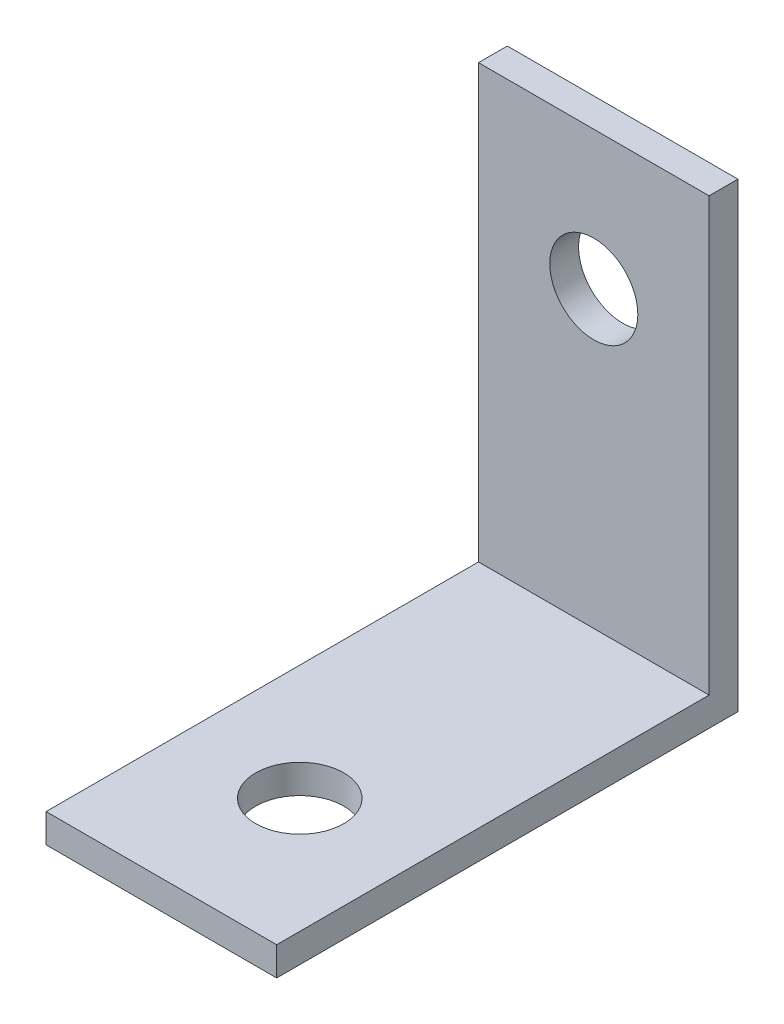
ISO-10303-21;
HEADER;
FILE_DESCRIPTION(('STEP AP214'),'2;1');
FILE_NAME('part.step','',(''),(''),'','','');
FILE_SCHEMA(('AUTOMOTIVE_DESIGN { 1 0 10303 214 1 1 1 1 }'));
ENDSEC;
DATA;
#1=APPLICATION_CONTEXT('core data for automotive mechanical design processes');
#2=APPLICATION_PROTOCOL_DEFINITION('international standard','automotive_design',2000,#1);
#3=PRODUCT_CONTEXT('',#1,'mechanical');
#4=PRODUCT('Part','Part','',(#3));
#5=PRODUCT_RELATED_PRODUCT_CATEGORY('part','',(#4));
#6=PRODUCT_DEFINITION_FORMATION('','',#4);
#7=PRODUCT_DEFINITION_CONTEXT('part definition',#1,'design');
#8=PRODUCT_DEFINITION('design','',#6,#7);
#9=PRODUCT_DEFINITION_SHAPE('','',#8);
#10=(LENGTH_UNIT() NAMED_UNIT(*) SI_UNIT(.MILLI.,.METRE.));
#11=(NAMED_UNIT(*) PLANE_ANGLE_UNIT() SI_UNIT($,.RADIAN.));
#12=(NAMED_UNIT(*) SI_UNIT($,.STERADIAN.) SOLID_ANGLE_UNIT());
#13=UNCERTAINTY_MEASURE_WITH_UNIT(LENGTH_MEASURE(1.E-05),#10,'distance_accuracy_value','');
#14=(GEOMETRIC_REPRESENTATION_CONTEXT(3) GLOBAL_UNCERTAINTY_ASSIGNED_CONTEXT((#13)) GLOBAL_UNIT_ASSIGNED_CONTEXT((#10,
#11,#12)) REPRESENTATION_CONTEXT('',''));
#15=CARTESIAN_POINT('',(0.,0.,0.));
#16=DIRECTION('',(0.,0.,1.));
#17=DIRECTION('',(1.,0.,0.));
#18=AXIS2_PLACEMENT_3D('',#15,#16,#17);
#19=CARTESIAN_POINT('',(6.35,0.,0.));
#20=DIRECTION('',(0.,1.,0.));
#21=DIRECTION('',(0.,0.,1.));
#22=AXIS2_PLACEMENT_3D('',#19,#20,#21);
#23=PLANE('',#22);
#24=CARTESIAN_POINT('',(0.,0.,17.78));
#25=DIRECTION('',(0.,-1.,0.));
#26=DIRECTION('',(1.,0.,0.));
#27=AXIS2_PLACEMENT_3D('',#24,#25,#26);
#28=CIRCLE('',#27,2.4257);
#29=CARTESIAN_POINT('',(0.,0.,20.2057));
#30=VERTEX_POINT('',#29);
#31=EDGE_CURVE('E155',#30,#30,#28,.T.);
#32=ORIENTED_EDGE('',*,*,#31,.F.);
#33=EDGE_LOOP('',(#32));
#34=FACE_BOUND('',#33,.T.);
#35=DIRECTION('',(0.,0.,-1.));
#36=VECTOR('',#35,1.);
#37=CARTESIAN_POINT('',(-6.35,0.,0.));
#38=LINE('',#37,#36);
#39=CARTESIAN_POINT('',(-6.35,0.,25.4));
#40=VERTEX_POINT('',#39);
#41=CARTESIAN_POINT('',(-6.35,0.,0.));
#42=VERTEX_POINT('',#41);
#43=EDGE_CURVE('E130',#40,#42,#38,.T.);
#44=ORIENTED_EDGE('',*,*,#43,.T.);
#45=DIRECTION('',(-1.,0.,0.));
#46=VECTOR('',#45,1.);
#47=CARTESIAN_POINT('',(6.35,0.,0.));
#48=LINE('',#47,#46);
#49=CARTESIAN_POINT('',(6.35,0.,0.));
#50=VERTEX_POINT('',#49);
#51=EDGE_CURVE('E11',#50,#42,#48,.T.);
#52=ORIENTED_EDGE('',*,*,#51,.F.);
#53=DIRECTION('',(0.,0.,-1.));
#54=VECTOR('',#53,1.);
#55=CARTESIAN_POINT('',(6.35,0.,0.));
#56=LINE('',#55,#54);
#57=CARTESIAN_POINT('',(6.35,0.,25.4));
#58=VERTEX_POINT('',#57);
#59=EDGE_CURVE('E137',#58,#50,#56,.T.);
#60=ORIENTED_EDGE('',*,*,#59,.F.);
#61=DIRECTION('',(-1.,0.,0.));
#62=VECTOR('',#61,1.);
#63=CARTESIAN_POINT('',(6.35,0.,25.4));
#64=LINE('',#63,#62);
#65=EDGE_CURVE('E122',#58,#40,#64,.T.);
#66=ORIENTED_EDGE('',*,*,#65,.T.);
#67=EDGE_LOOP('',(#44,#52,#60,#66));
#68=FACE_BOUND('',#67,.T.);
#69=ADVANCED_FACE('F41',(#34,#68),#23,.F.);
#70=CARTESIAN_POINT('',(6.35,0.,0.));
#71=DIRECTION('',(0.,0.,1.));
#72=DIRECTION('',(1.,0.,0.));
#73=AXIS2_PLACEMENT_3D('',#70,#71,#72);
#74=PLANE('',#73);
#75=CARTESIAN_POINT('',(0.,17.78,0.));
#76=DIRECTION('',(0.,0.,1.));
#77=DIRECTION('',(1.,0.,0.));
#78=AXIS2_PLACEMENT_3D('',#75,#76,#77);
#79=CIRCLE('',#78,2.4257);
#80=CARTESIAN_POINT('',(2.4257,17.78,0.));
#81=VERTEX_POINT('',#80);
#82=EDGE_CURVE('E145',#81,#81,#79,.T.);
#83=ORIENTED_EDGE('',*,*,#82,.T.);
#84=EDGE_LOOP('',(#83));
#85=FACE_BOUND('',#84,.T.);
#86=DIRECTION('',(0.,1.,0.));
#87=VECTOR('',#86,1.);
#88=CARTESIAN_POINT('',(-6.35,0.,0.));
#89=LINE('',#88,#87);
#90=CARTESIAN_POINT('',(-6.35,25.4,0.));
#91=VERTEX_POINT('',#90);
#92=EDGE_CURVE('E128',#42,#91,#89,.T.);
#93=ORIENTED_EDGE('',*,*,#92,.T.);
#94=DIRECTION('',(-1.,0.,0.));
#95=VECTOR('',#94,1.);
#96=CARTESIAN_POINT('',(6.35,25.4,0.));
#97=LINE('',#96,#95);
#98=CARTESIAN_POINT('',(6.35,25.4,0.));
#99=VERTEX_POINT('',#98);
#100=EDGE_CURVE('E49',#99,#91,#97,.T.);
#101=ORIENTED_EDGE('',*,*,#100,.F.);
#102=DIRECTION('',(0.,1.,0.));
#103=VECTOR('',#102,1.);
#104=CARTESIAN_POINT('',(6.35,0.,0.));
#105=LINE('',#104,#103);
#106=EDGE_CURVE('E96',#50,#99,#105,.T.);
#107=ORIENTED_EDGE('',*,*,#106,.F.);
#108=ORIENTED_EDGE('',*,*,#51,.T.);
#109=EDGE_LOOP('',(#93,#101,#107,#108));
#110=FACE_BOUND('',#109,.T.);
#111=ADVANCED_FACE('F158',(#85,#110),#74,.F.);
#112=CARTESIAN_POINT('',(6.35,25.4,0.));
#113=DIRECTION('',(0.,-1.,0.));
#114=DIRECTION('',(0.,0.,-1.));
#115=AXIS2_PLACEMENT_3D('',#112,#113,#114);
#116=PLANE('',#115);
#117=DIRECTION('',(0.,0.,1.));
#118=VECTOR('',#117,1.);
#119=CARTESIAN_POINT('',(-6.35,25.4,0.));
#120=LINE('',#119,#118);
#121=CARTESIAN_POINT('',(-6.35,25.4,1.5875));
#122=VERTEX_POINT('',#121);
#123=EDGE_CURVE('E132',#91,#122,#120,.T.);
#124=ORIENTED_EDGE('',*,*,#123,.T.);
#125=DIRECTION('',(-1.,0.,0.));
#126=VECTOR('',#125,1.);
#127=CARTESIAN_POINT('',(6.35,25.4,1.5875));
#128=LINE('',#127,#126);
#129=CARTESIAN_POINT('',(6.35,25.4,1.5875));
#130=VERTEX_POINT('',#129);
#131=EDGE_CURVE('E117',#130,#122,#128,.T.);
#132=ORIENTED_EDGE('',*,*,#131,.F.);
#133=DIRECTION('',(0.,0.,1.));
#134=VECTOR('',#133,1.);
#135=CARTESIAN_POINT('',(6.35,25.4,0.));
#136=LINE('',#135,#134);
#137=EDGE_CURVE('E108',#99,#130,#136,.T.);
#138=ORIENTED_EDGE('',*,*,#137,.F.);
#139=ORIENTED_EDGE('',*,*,#100,.T.);
#140=EDGE_LOOP('',(#124,#132,#138,#139));
#141=FACE_BOUND('',#140,.T.);
#142=ADVANCED_FACE('F161',(#141),#116,.F.);
#143=CARTESIAN_POINT('',(6.35,1.5875,1.5875));
#144=DIRECTION('',(0.,0.,-1.));
#145=DIRECTION('',(-1.,0.,0.));
#146=AXIS2_PLACEMENT_3D('',#143,#144,#145);
#147=PLANE('',#146);
#148=CARTESIAN_POINT('',(0.,17.78,1.5875));
#149=DIRECTION('',(0.,0.,-1.));
#150=DIRECTION('',(-1.,0.,0.));
#151=AXIS2_PLACEMENT_3D('',#148,#149,#150);
#152=CIRCLE('',#151,2.4257);
#153=CARTESIAN_POINT('',(-2.4257,17.78,1.5875));
#154=VERTEX_POINT('',#153);
#155=EDGE_CURVE('E131',#154,#154,#152,.T.);
#156=ORIENTED_EDGE('',*,*,#155,.T.);
#157=EDGE_LOOP('',(#156));
#158=FACE_BOUND('',#157,.T.);
#159=DIRECTION('',(0.,-1.,0.));
#160=VECTOR('',#159,1.);
#161=CARTESIAN_POINT('',(-6.35,1.5875,1.5875));
#162=LINE('',#161,#160);
#163=CARTESIAN_POINT('',(-6.35,1.5875,1.5875));
#164=VERTEX_POINT('',#163);
#165=EDGE_CURVE('E120',#122,#164,#162,.T.);
#166=ORIENTED_EDGE('',*,*,#165,.T.);
#167=DIRECTION('',(-1.,0.,0.));
#168=VECTOR('',#167,1.);
#169=CARTESIAN_POINT('',(6.35,1.5875,1.5875));
#170=LINE('',#169,#168);
#171=CARTESIAN_POINT('',(6.35,1.5875,1.5875));
#172=VERTEX_POINT('',#171);
#173=EDGE_CURVE('E111',#172,#164,#170,.T.);
#174=ORIENTED_EDGE('',*,*,#173,.F.);
#175=DIRECTION('',(0.,-1.,0.));
#176=VECTOR('',#175,1.);
#177=CARTESIAN_POINT('',(6.35,1.5875,1.5875));
#178=LINE('',#177,#176);
#179=EDGE_CURVE('E103',#130,#172,#178,.T.);
#180=ORIENTED_EDGE('',*,*,#179,.F.);
#181=ORIENTED_EDGE('',*,*,#131,.T.);
#182=EDGE_LOOP('',(#166,#174,#180,#181));
#183=FACE_BOUND('',#182,.T.);
#184=ADVANCED_FACE('F113',(#158,#183),#147,.F.);
#185=CARTESIAN_POINT('',(6.35,1.5875,1.5875));
#186=DIRECTION('',(0.,-1.,0.));
#187=DIRECTION('',(0.,0.,-1.));
#188=AXIS2_PLACEMENT_3D('',#185,#186,#187);
#189=PLANE('',#188);
#190=CARTESIAN_POINT('',(0.,1.5875,17.78));
#191=DIRECTION('',(0.,-1.,0.));
#192=DIRECTION('',(0.,0.,-1.));
#193=AXIS2_PLACEMENT_3D('',#190,#191,#192);
#194=CIRCLE('',#193,2.4257);
#195=CARTESIAN_POINT('',(0.,1.5875,20.2057));
#196=VERTEX_POINT('',#195);
#197=EDGE_CURVE('E42',#196,#196,#194,.F.);
#198=ORIENTED_EDGE('',*,*,#197,.F.);
#199=EDGE_LOOP('',(#198));
#200=FACE_BOUND('',#199,.T.);
#201=DIRECTION('',(0.,0.,1.));
#202=VECTOR('',#201,1.);
#203=CARTESIAN_POINT('',(-6.35,1.5875,1.5875));
#204=LINE('',#203,#202);
#205=CARTESIAN_POINT('',(-6.35,1.5875,25.4));
#206=VERTEX_POINT('',#205);
#207=EDGE_CURVE('E84',#164,#206,#204,.T.);
#208=ORIENTED_EDGE('',*,*,#207,.T.);
#209=DIRECTION('',(-1.,0.,0.));
#210=VECTOR('',#209,1.);
#211=CARTESIAN_POINT('',(6.35,1.5875,25.4));
#212=LINE('',#211,#210);
#213=CARTESIAN_POINT('',(6.35,1.5875,25.4));
#214=VERTEX_POINT('',#213);
#215=EDGE_CURVE('E118',#214,#206,#212,.T.);
#216=ORIENTED_EDGE('',*,*,#215,.F.);
#217=DIRECTION('',(0.,0.,1.));
#218=VECTOR('',#217,1.);
#219=CARTESIAN_POINT('',(6.35,1.5875,1.5875));
#220=LINE('',#219,#218);
#221=EDGE_CURVE('E110',#172,#214,#220,.T.);
#222=ORIENTED_EDGE('',*,*,#221,.F.);
#223=ORIENTED_EDGE('',*,*,#173,.T.);
#224=EDGE_LOOP('',(#208,#216,#222,#223));
#225=FACE_BOUND('',#224,.T.);
#226=ADVANCED_FACE('F123',(#200,#225),#189,.F.);
#227=CARTESIAN_POINT('',(6.35,1.5875,25.4));
#228=DIRECTION('',(0.,0.,-1.));
#229=DIRECTION('',(-1.,0.,0.));
#230=AXIS2_PLACEMENT_3D('',#227,#228,#229);
#231=PLANE('',#230);
#232=DIRECTION('',(0.,-1.,0.));
#233=VECTOR('',#232,1.);
#234=CARTESIAN_POINT('',(-6.35,1.5875,25.4));
#235=LINE('',#234,#233);
#236=EDGE_CURVE('E86',#206,#40,#235,.T.);
#237=ORIENTED_EDGE('',*,*,#236,.T.);
#238=ORIENTED_EDGE('',*,*,#65,.F.);
#239=DIRECTION('',(0.,-1.,0.));
#240=VECTOR('',#239,1.);
#241=CARTESIAN_POINT('',(6.35,1.5875,25.4));
#242=LINE('',#241,#240);
#243=EDGE_CURVE('E56',#214,#58,#242,.T.);
#244=ORIENTED_EDGE('',*,*,#243,.F.);
#245=ORIENTED_EDGE('',*,*,#215,.T.);
#246=EDGE_LOOP('',(#237,#238,#244,#245));
#247=FACE_BOUND('',#246,.T.);
#248=ADVANCED_FACE('F167',(#247),#231,.F.);
#249=CARTESIAN_POINT('',(6.35,0.,0.));
#250=DIRECTION('',(1.,0.,0.));
#251=DIRECTION('',(0.,0.,-1.));
#252=AXIS2_PLACEMENT_3D('',#249,#250,#251);
#253=PLANE('',#252);
#254=ORIENTED_EDGE('',*,*,#59,.T.);
#255=ORIENTED_EDGE('',*,*,#106,.T.);
#256=ORIENTED_EDGE('',*,*,#137,.T.);
#257=ORIENTED_EDGE('',*,*,#179,.T.);
#258=ORIENTED_EDGE('',*,*,#221,.T.);
#259=ORIENTED_EDGE('',*,*,#243,.T.);
#260=EDGE_LOOP('',(#254,#255,#256,#257,#258,#259));
#261=FACE_BOUND('',#260,.T.);
#262=ADVANCED_FACE('F104',(#261),#253,.T.);
#263=CARTESIAN_POINT('',(-6.35,0.,0.));
#264=DIRECTION('',(1.,0.,0.));
#265=DIRECTION('',(0.,0.,-1.));
#266=AXIS2_PLACEMENT_3D('',#263,#264,#265);
#267=PLANE('',#266);
#268=ORIENTED_EDGE('',*,*,#43,.F.);
#269=ORIENTED_EDGE('',*,*,#236,.F.);
#270=ORIENTED_EDGE('',*,*,#207,.F.);
#271=ORIENTED_EDGE('',*,*,#165,.F.);
#272=ORIENTED_EDGE('',*,*,#123,.F.);
#273=ORIENTED_EDGE('',*,*,#92,.F.);
#274=EDGE_LOOP('',(#268,#269,#270,#271,#272,#273));
#275=FACE_BOUND('',#274,.T.);
#276=ADVANCED_FACE('F163',(#275),#267,.F.);
#277=CARTESIAN_POINT('',(0.,17.78,0.));
#278=DIRECTION('',(0.,0.,1.));
#279=DIRECTION('',(1.,0.,0.));
#280=AXIS2_PLACEMENT_3D('',#277,#278,#279);
#281=CYLINDRICAL_SURFACE('',#280,2.4257);
#282=ORIENTED_EDGE('',*,*,#82,.F.);
#283=EDGE_LOOP('',(#282));
#284=FACE_BOUND('',#283,.T.);
#285=ORIENTED_EDGE('',*,*,#155,.F.);
#286=EDGE_LOOP('',(#285));
#287=FACE_BOUND('',#286,.T.);
#288=ADVANCED_FACE('F189',(#284,#287),#281,.F.);
#289=CARTESIAN_POINT('',(0.,0.,17.78));
#290=DIRECTION('',(0.,1.,0.));
#291=DIRECTION('',(0.,0.,1.));
#292=AXIS2_PLACEMENT_3D('',#289,#290,#291);
#293=CYLINDRICAL_SURFACE('',#292,2.4257);
#294=CARTESIAN_POINT('',(0.,0.,20.2057));
#295=CARTESIAN_POINT('',(0.,0.016536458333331,20.2057));
#296=CARTESIAN_POINT('',(0.,0.0330729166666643,20.2057));
#297=CARTESIAN_POINT('',(0.,0.066145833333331,20.2057));
#298=CARTESIAN_POINT('',(0.,0.0826822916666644,20.2057));
#299=CARTESIAN_POINT('',(0.,0.115755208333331,20.2057));
#300=CARTESIAN_POINT('',(0.,0.132291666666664,20.2057));
#301=CARTESIAN_POINT('',(0.,0.165364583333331,20.2057));
#302=CARTESIAN_POINT('',(0.,0.181901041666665,20.2057));
#303=CARTESIAN_POINT('',(0.,0.214973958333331,20.2057));
#304=CARTESIAN_POINT('',(0.,0.231510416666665,20.2057));
#305=CARTESIAN_POINT('',(0.,0.264583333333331,20.2057));
#306=CARTESIAN_POINT('',(0.,0.281119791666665,20.2057));
#307=CARTESIAN_POINT('',(0.,0.314192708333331,20.2057));
#308=CARTESIAN_POINT('',(0.,0.330729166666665,20.2057));
#309=CARTESIAN_POINT('',(0.,0.363802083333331,20.2057));
#310=CARTESIAN_POINT('',(0.,0.380338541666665,20.2057));
#311=CARTESIAN_POINT('',(0.,0.413411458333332,20.2057));
#312=CARTESIAN_POINT('',(0.,0.429947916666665,20.2057));
#313=CARTESIAN_POINT('',(0.,0.463020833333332,20.2057));
#314=CARTESIAN_POINT('',(0.,0.479557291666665,20.2057));
#315=CARTESIAN_POINT('',(0.,0.512630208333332,20.2057));
#316=CARTESIAN_POINT('',(0.,0.529166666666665,20.2057));
#317=CARTESIAN_POINT('',(0.,0.562239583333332,20.2057));
#318=CARTESIAN_POINT('',(0.,0.578776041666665,20.2057));
#319=CARTESIAN_POINT('',(0.,0.611848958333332,20.2057));
#320=CARTESIAN_POINT('',(0.,0.628385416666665,20.2057));
#321=CARTESIAN_POINT('',(0.,0.661458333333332,20.2057));
#322=CARTESIAN_POINT('',(0.,0.677994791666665,20.2057));
#323=CARTESIAN_POINT('',(0.,0.711067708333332,20.2057));
#324=CARTESIAN_POINT('',(0.,0.727604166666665,20.2057));
#325=CARTESIAN_POINT('',(0.,0.760677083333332,20.2057));
#326=CARTESIAN_POINT('',(0.,0.777213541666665,20.2057));
#327=CARTESIAN_POINT('',(0.,0.810286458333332,20.2057));
#328=CARTESIAN_POINT('',(0.,0.826822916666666,20.2057));
#329=CARTESIAN_POINT('',(0.,0.859895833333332,20.2057));
#330=CARTESIAN_POINT('',(0.,0.876432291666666,20.2057));
#331=CARTESIAN_POINT('',(0.,0.909505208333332,20.2057));
#332=CARTESIAN_POINT('',(0.,0.926041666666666,20.2057));
#333=CARTESIAN_POINT('',(0.,0.959114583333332,20.2057));
#334=CARTESIAN_POINT('',(0.,0.975651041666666,20.2057));
#335=CARTESIAN_POINT('',(0.,1.00872395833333,20.2057));
#336=CARTESIAN_POINT('',(0.,1.02526041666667,20.2057));
#337=CARTESIAN_POINT('',(0.,1.05833333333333,20.2057));
#338=CARTESIAN_POINT('',(0.,1.07486979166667,20.2057));
#339=CARTESIAN_POINT('',(0.,1.10794270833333,20.2057));
#340=CARTESIAN_POINT('',(0.,1.12447916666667,20.2057));
#341=CARTESIAN_POINT('',(0.,1.15755208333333,20.2057));
#342=CARTESIAN_POINT('',(0.,1.17408854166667,20.2057));
#343=CARTESIAN_POINT('',(0.,1.20716145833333,20.2057));
#344=CARTESIAN_POINT('',(0.,1.22369791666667,20.2057));
#345=CARTESIAN_POINT('',(0.,1.25677083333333,20.2057));
#346=CARTESIAN_POINT('',(0.,1.27330729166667,20.2057));
#347=CARTESIAN_POINT('',(0.,1.30638020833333,20.2057));
#348=CARTESIAN_POINT('',(0.,1.32291666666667,20.2057));
#349=CARTESIAN_POINT('',(0.,1.35598958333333,20.2057));
#350=CARTESIAN_POINT('',(0.,1.37252604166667,20.2057));
#351=CARTESIAN_POINT('',(0.,1.40559895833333,20.2057));
#352=CARTESIAN_POINT('',(0.,1.42213541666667,20.2057));
#353=CARTESIAN_POINT('',(0.,1.45520833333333,20.2057));
#354=CARTESIAN_POINT('',(0.,1.47174479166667,20.2057));
#355=CARTESIAN_POINT('',(0.,1.50481770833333,20.2057));
#356=CARTESIAN_POINT('',(0.,1.52135416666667,20.2057));
#357=CARTESIAN_POINT('',(0.,1.55442708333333,20.2057));
#358=CARTESIAN_POINT('',(0.,1.57096354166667,20.2057));
#359=CARTESIAN_POINT('',(0.,1.5875,20.2057));
#360=B_SPLINE_CURVE_WITH_KNOTS('',3,(#294,#295,#296,#297,#298,#299,#300,#301,#302,#303,#304,
#305,#306,#307,#308,#309,#310,#311,#312,#313,#314,#315,#316,#317,#318,#319,#320,#321,#322,#323,
#324,#325,#326,#327,#328,#329,#330,#331,#332,#333,#334,#335,#336,#337,#338,#339,#340,#341,#342,
#343,#344,#345,#346,#347,#348,#349,#350,#351,#352,#353,#354,#355,#356,#357,#358,#359),
.UNSPECIFIED.,.F.,.F.,(4,2,2,2,2,2,2,2,2,2,2,2,2,2,2,2,2,2,2,2,2,2,2,2,2,2,2,2,2,2,2,2,4),(0.,
0.0496093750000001,0.0992187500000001,0.148828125,0.1984375,0.248046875,0.29765625,
0.347265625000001,0.396875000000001,0.446484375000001,0.496093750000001,0.545703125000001,
0.595312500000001,0.644921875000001,0.694531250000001,0.744140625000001,0.793750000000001,
0.843359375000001,0.892968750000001,0.942578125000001,0.992187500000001,1.041796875,1.09140625,
1.141015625,1.190625,1.240234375,1.28984375,1.339453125,1.3890625,1.438671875,1.48828125,
1.537890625,1.5875),.UNSPECIFIED.);
#361=EDGE_CURVE('BSEAM190',#30,#196,#360,.T.);
#362=ORIENTED_EDGE('',*,*,#31,.T.);
#363=ORIENTED_EDGE('',*,*,#197,.T.);
#364=ORIENTED_EDGE('',*,*,#361,.T.);
#365=ORIENTED_EDGE('',*,*,#361,.F.);
#366=EDGE_LOOP('',(#362,#364,#363,#365));
#367=FACE_BOUND('',#366,.T.);
#368=ADVANCED_FACE('F190',(#367),#293,.F.);
#369=CLOSED_SHELL('',(#69,#111,#142,#184,#226,#248,#262,#276,#288,#368));
#370=MANIFOLD_SOLID_BREP('B2',#369);
#371=ADVANCED_BREP_SHAPE_REPRESENTATION('',(#18,#370),#14);
#372=SHAPE_DEFINITION_REPRESENTATION(#9,#371);
ENDSEC;
END-ISO-10303-21;
